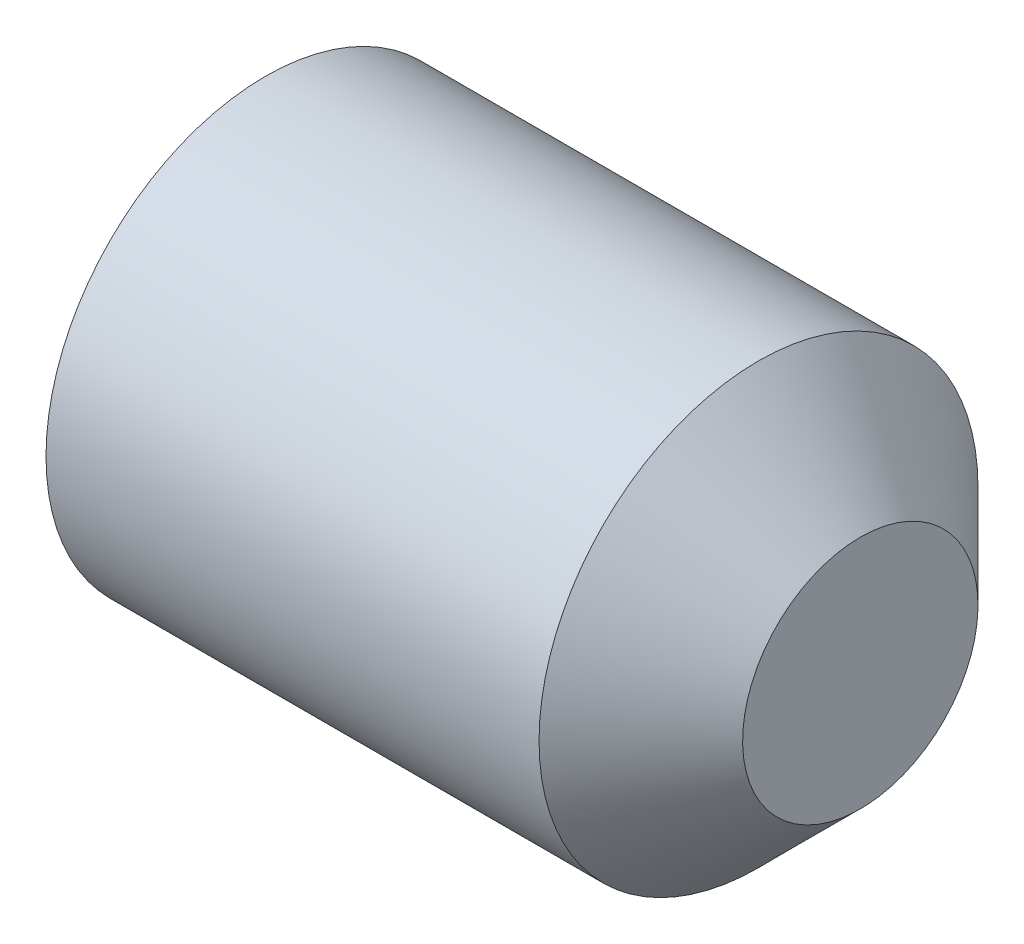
from build123d import *

# Parameters (mm, degrees)
CUT_EXTRUDE1_DEPTH = 1.905


with BuildPart() as part:
    # Sketch1 → Revolve3 (revolve)
    with BuildSketch(Plane.XY):
        Polygon((0, 1.7526), (3.937, 1.7526), (4.7498, 0.9398), (4.7498, 0), (0, 0), align=None)
    revolve(axis=Axis((4.7498, 0, 0), (-1, 0, 0)))

    # Sketch2 → Cut-Extrude1 (cut)
    with BuildSketch(Plane.ZY):
        Polygon((0.893199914, -0.236094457), (0.651063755, 0.655486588), (-0.24213616, 0.891581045), (-0.893199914, 0.236094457), (-0.651063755, -0.655486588), (0.24213616, -0.891581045), align=None)
    extrude(amount=-CUT_EXTRUDE1_DEPTH, mode=Mode.SUBTRACT)


solid = part.part
